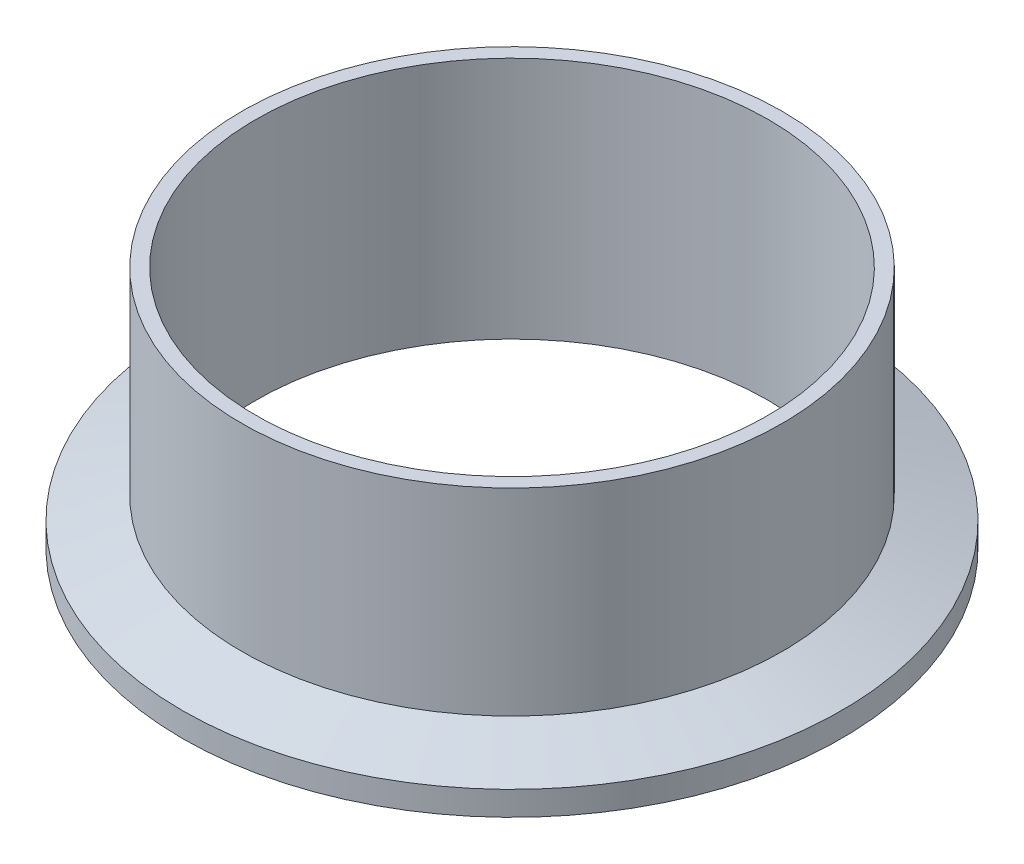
ISO-10303-21;
HEADER;
FILE_DESCRIPTION(('STEP AP214'),'2;1');
FILE_NAME('part.step','',(''),(''),'','','');
FILE_SCHEMA(('AUTOMOTIVE_DESIGN { 1 0 10303 214 1 1 1 1 }'));
ENDSEC;
DATA;
#1=APPLICATION_CONTEXT('core data for automotive mechanical design processes');
#2=APPLICATION_PROTOCOL_DEFINITION('international standard','automotive_design',2000,#1);
#3=PRODUCT_CONTEXT('',#1,'mechanical');
#4=PRODUCT('Part','Part','',(#3));
#5=PRODUCT_RELATED_PRODUCT_CATEGORY('part','',(#4));
#6=PRODUCT_DEFINITION_FORMATION('','',#4);
#7=PRODUCT_DEFINITION_CONTEXT('part definition',#1,'design');
#8=PRODUCT_DEFINITION('design','',#6,#7);
#9=PRODUCT_DEFINITION_SHAPE('','',#8);
#10=(LENGTH_UNIT() NAMED_UNIT(*) SI_UNIT(.MILLI.,.METRE.));
#11=(NAMED_UNIT(*) PLANE_ANGLE_UNIT() SI_UNIT($,.RADIAN.));
#12=(NAMED_UNIT(*) SI_UNIT($,.STERADIAN.) SOLID_ANGLE_UNIT());
#13=UNCERTAINTY_MEASURE_WITH_UNIT(LENGTH_MEASURE(1.E-05),#10,'distance_accuracy_value','');
#14=(GEOMETRIC_REPRESENTATION_CONTEXT(3) GLOBAL_UNCERTAINTY_ASSIGNED_CONTEXT((#13)) GLOBAL_UNIT_ASSIGNED_CONTEXT((#10,
#11,#12)) REPRESENTATION_CONTEXT('',''));
#15=CARTESIAN_POINT('',(0.,0.,0.));
#16=DIRECTION('',(0.,0.,1.));
#17=DIRECTION('',(1.,0.,0.));
#18=AXIS2_PLACEMENT_3D('',#15,#16,#17);
#19=CARTESIAN_POINT('',(0.,0.7874,0.));
#20=DIRECTION('',(0.,-1.,0.));
#21=DIRECTION('',(0.,0.,-1.));
#22=AXIS2_PLACEMENT_3D('',#19,#20,#21);
#23=TOROIDAL_SURFACE('',#22,37.1367084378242,0.787400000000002);
#24=CARTESIAN_POINT('',(0.,0.,0.));
#25=DIRECTION('',(0.,-1.,0.));
#26=DIRECTION('',(0.,0.,-1.));
#27=AXIS2_PLACEMENT_3D('',#24,#25,#26);
#28=CIRCLE('',#27,37.1367084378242);
#29=CARTESIAN_POINT('',(0.,0.,-37.1367084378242));
#30=VERTEX_POINT('',#29);
#31=EDGE_CURVE('E67',#30,#30,#28,.T.);
#32=ORIENTED_EDGE('',*,*,#31,.T.);
#33=EDGE_LOOP('',(#32));
#34=FACE_BOUND('',#33,.T.);
#35=CARTESIAN_POINT('',(0.,0.474458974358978,0.));
#36=DIRECTION('',(0.,-1.,0.));
#37=DIRECTION('',(0.,0.,-1.));
#38=AXIS2_PLACEMENT_3D('',#35,#36,#37);
#39=CIRCLE('',#38,36.4141666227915);
#40=CARTESIAN_POINT('',(0.,0.474458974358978,-36.4141666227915));
#41=VERTEX_POINT('',#40);
#42=EDGE_CURVE('E10',#41,#41,#39,.T.);
#43=ORIENTED_EDGE('',*,*,#42,.F.);
#44=EDGE_LOOP('',(#43));
#45=FACE_BOUND('',#44,.T.);
#46=ADVANCED_FACE('F33',(#34,#45),#23,.T.);
#47=CARTESIAN_POINT('',(0.,0.,0.));
#48=DIRECTION('',(0.,-1.,0.));
#49=DIRECTION('',(0.,0.,-1.));
#50=AXIS2_PLACEMENT_3D('',#47,#48,#49);
#51=TOROIDAL_SURFACE('',#50,35.3187,1.1938);
#52=CARTESIAN_POINT('',(0.,0.474458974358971,0.));
#53=DIRECTION('',(0.,-1.,0.));
#54=DIRECTION('',(0.,0.,-1.));
#55=AXIS2_PLACEMENT_3D('',#52,#53,#54);
#56=CIRCLE('',#55,34.2232333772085);
#57=CARTESIAN_POINT('',(0.,0.474458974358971,-34.2232333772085));
#58=VERTEX_POINT('',#57);
#59=EDGE_CURVE('E39',#58,#58,#56,.T.);
#60=ORIENTED_EDGE('',*,*,#59,.F.);
#61=EDGE_LOOP('',(#60));
#62=FACE_BOUND('',#61,.T.);
#63=ORIENTED_EDGE('',*,*,#42,.T.);
#64=EDGE_LOOP('',(#63));
#65=FACE_BOUND('',#64,.T.);
#66=ADVANCED_FACE('F115',(#62,#65),#51,.F.);
#67=CARTESIAN_POINT('',(0.,0.7874,0.));
#68=DIRECTION('',(0.,-1.,0.));
#69=DIRECTION('',(0.,0.,-1.));
#70=AXIS2_PLACEMENT_3D('',#67,#68,#69);
#71=TOROIDAL_SURFACE('',#70,33.5006915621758,0.787399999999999);
#72=ORIENTED_EDGE('',*,*,#59,.T.);
#73=EDGE_LOOP('',(#72));
#74=FACE_BOUND('',#73,.T.);
#75=CARTESIAN_POINT('',(0.,0.,0.));
#76=DIRECTION('',(0.,-1.,0.));
#77=DIRECTION('',(0.,0.,-1.));
#78=AXIS2_PLACEMENT_3D('',#75,#76,#77);
#79=CIRCLE('',#78,33.5006915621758);
#80=CARTESIAN_POINT('',(0.,0.,-33.5006915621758));
#81=VERTEX_POINT('',#80);
#82=EDGE_CURVE('E43',#81,#81,#79,.T.);
#83=ORIENTED_EDGE('',*,*,#82,.F.);
#84=EDGE_LOOP('',(#83));
#85=FACE_BOUND('',#84,.T.);
#86=ADVANCED_FACE('F111',(#74,#85),#71,.T.);
#87=CARTESIAN_POINT('',(0.,0.,0.));
#88=DIRECTION('',(0.,1.,0.));
#89=DIRECTION('',(0.,0.,1.));
#90=AXIS2_PLACEMENT_3D('',#87,#88,#89);
#91=PLANE('',#90);
#92=CARTESIAN_POINT('',(0.,0.,0.));
#93=DIRECTION('',(0.,-1.,0.));
#94=DIRECTION('',(0.,0.,-1.));
#95=AXIS2_PLACEMENT_3D('',#92,#93,#94);
#96=CIRCLE('',#95,30.099);
#97=CARTESIAN_POINT('',(0.,0.,-30.099));
#98=VERTEX_POINT('',#97);
#99=EDGE_CURVE('E47',#98,#98,#96,.T.);
#100=ORIENTED_EDGE('',*,*,#99,.F.);
#101=EDGE_LOOP('',(#100));
#102=FACE_BOUND('',#101,.T.);
#103=ORIENTED_EDGE('',*,*,#82,.T.);
#104=EDGE_LOOP('',(#103));
#105=FACE_BOUND('',#104,.T.);
#106=ADVANCED_FACE('F105',(#102,#105),#91,.F.);
#107=CARTESIAN_POINT('',(0.,0.,0.));
#108=DIRECTION('',(0.,-1.,0.));
#109=DIRECTION('',(0.,0.,-1.));
#110=AXIS2_PLACEMENT_3D('',#107,#108,#109);
#111=CYLINDRICAL_SURFACE('',#110,30.099);
#112=ORIENTED_EDGE('',*,*,#99,.T.);
#113=EDGE_LOOP('',(#112));
#114=FACE_BOUND('',#113,.T.);
#115=CARTESIAN_POINT('',(0.,28.575,0.));
#116=DIRECTION('',(0.,-1.,0.));
#117=DIRECTION('',(0.,0.,-1.));
#118=AXIS2_PLACEMENT_3D('',#115,#116,#117);
#119=CIRCLE('',#118,30.099);
#120=CARTESIAN_POINT('',(0.,28.575,-30.099));
#121=VERTEX_POINT('',#120);
#122=EDGE_CURVE('E52',#121,#121,#119,.T.);
#123=ORIENTED_EDGE('',*,*,#122,.F.);
#124=EDGE_LOOP('',(#123));
#125=FACE_BOUND('',#124,.T.);
#126=ADVANCED_FACE('F100',(#114,#125),#111,.F.);
#127=CARTESIAN_POINT('',(0.,28.575,0.));
#128=DIRECTION('',(0.,-1.,0.));
#129=DIRECTION('',(0.,0.,-1.));
#130=AXIS2_PLACEMENT_3D('',#127,#128,#129);
#131=PLANE('',#130);
#132=CARTESIAN_POINT('',(0.,28.575,0.));
#133=DIRECTION('',(0.,-1.,0.));
#134=DIRECTION('',(0.,0.,-1.));
#135=AXIS2_PLACEMENT_3D('',#132,#133,#134);
#136=CIRCLE('',#135,31.75);
#137=CARTESIAN_POINT('',(0.,28.575,-31.75));
#138=VERTEX_POINT('',#137);
#139=EDGE_CURVE('E55',#138,#138,#136,.T.);
#140=ORIENTED_EDGE('',*,*,#139,.F.);
#141=EDGE_LOOP('',(#140));
#142=FACE_BOUND('',#141,.T.);
#143=ORIENTED_EDGE('',*,*,#122,.T.);
#144=EDGE_LOOP('',(#143));
#145=FACE_BOUND('',#144,.T.);
#146=ADVANCED_FACE('F94',(#142,#145),#131,.F.);
#147=CARTESIAN_POINT('',(0.,0.,0.));
#148=DIRECTION('',(0.,-1.,0.));
#149=DIRECTION('',(0.,0.,-1.));
#150=AXIS2_PLACEMENT_3D('',#147,#148,#149);
#151=CYLINDRICAL_SURFACE('',#150,31.75);
#152=CARTESIAN_POINT('',(0.,5.37788724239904,0.));
#153=DIRECTION('',(0.,-1.,0.));
#154=DIRECTION('',(0.,0.,-1.));
#155=AXIS2_PLACEMENT_3D('',#152,#153,#154);
#156=CIRCLE('',#155,31.75);
#157=CARTESIAN_POINT('',(0.,5.37788724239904,-31.75));
#158=VERTEX_POINT('',#157);
#159=EDGE_CURVE('E58',#158,#158,#156,.T.);
#160=ORIENTED_EDGE('',*,*,#159,.F.);
#161=EDGE_LOOP('',(#160));
#162=FACE_BOUND('',#161,.T.);
#163=ORIENTED_EDGE('',*,*,#139,.T.);
#164=EDGE_LOOP('',(#163));
#165=FACE_BOUND('',#164,.T.);
#166=ADVANCED_FACE('F88',(#162,#165),#151,.T.);
#167=CARTESIAN_POINT('',(0.,5.37788724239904,0.));
#168=DIRECTION('',(0.,-1.,0.));
#169=DIRECTION('',(0.,0.,-1.));
#170=AXIS2_PLACEMENT_3D('',#167,#168,#169);
#171=CONICAL_SURFACE('',#170,31.75,1.22173047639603);
#172=CARTESIAN_POINT('',(0.,2.8448,0.));
#173=DIRECTION('',(0.,-1.,0.));
#174=DIRECTION('',(0.,0.,-1.));
#175=AXIS2_PLACEMENT_3D('',#172,#173,#174);
#176=CIRCLE('',#175,38.7096);
#177=CARTESIAN_POINT('',(0.,2.8448,-38.7096));
#178=VERTEX_POINT('',#177);
#179=EDGE_CURVE('E61',#178,#178,#176,.T.);
#180=ORIENTED_EDGE('',*,*,#179,.F.);
#181=EDGE_LOOP('',(#180));
#182=FACE_BOUND('',#181,.T.);
#183=ORIENTED_EDGE('',*,*,#159,.T.);
#184=EDGE_LOOP('',(#183));
#185=FACE_BOUND('',#184,.T.);
#186=ADVANCED_FACE('F82',(#182,#185),#171,.T.);
#187=CARTESIAN_POINT('',(0.,0.,0.));
#188=DIRECTION('',(0.,-1.,0.));
#189=DIRECTION('',(0.,0.,-1.));
#190=AXIS2_PLACEMENT_3D('',#187,#188,#189);
#191=CYLINDRICAL_SURFACE('',#190,38.7096);
#192=CARTESIAN_POINT('',(0.,0.,0.));
#193=DIRECTION('',(0.,-1.,0.));
#194=DIRECTION('',(0.,0.,-1.));
#195=AXIS2_PLACEMENT_3D('',#192,#193,#194);
#196=CIRCLE('',#195,38.7096);
#197=CARTESIAN_POINT('',(0.,0.,-38.7096));
#198=VERTEX_POINT('',#197);
#199=EDGE_CURVE('E64',#198,#198,#196,.T.);
#200=ORIENTED_EDGE('',*,*,#199,.F.);
#201=EDGE_LOOP('',(#200));
#202=FACE_BOUND('',#201,.T.);
#203=ORIENTED_EDGE('',*,*,#179,.T.);
#204=EDGE_LOOP('',(#203));
#205=FACE_BOUND('',#204,.T.);
#206=ADVANCED_FACE('F76',(#202,#205),#191,.T.);
#207=CARTESIAN_POINT('',(0.,0.,0.));
#208=DIRECTION('',(0.,1.,0.));
#209=DIRECTION('',(0.,0.,1.));
#210=AXIS2_PLACEMENT_3D('',#207,#208,#209);
#211=PLANE('',#210);
#212=ORIENTED_EDGE('',*,*,#31,.F.);
#213=EDGE_LOOP('',(#212));
#214=FACE_BOUND('',#213,.T.);
#215=ORIENTED_EDGE('',*,*,#199,.T.);
#216=EDGE_LOOP('',(#215));
#217=FACE_BOUND('',#216,.T.);
#218=ADVANCED_FACE('F73',(#214,#217),#211,.F.);
#219=CLOSED_SHELL('',(#46,#66,#86,#106,#126,#146,#166,#186,#206,#218));
#220=MANIFOLD_SOLID_BREP('B2',#219);
#221=ADVANCED_BREP_SHAPE_REPRESENTATION('',(#18,#220),#14);
#222=SHAPE_DEFINITION_REPRESENTATION(#9,#221);
ENDSEC;
END-ISO-10303-21;
